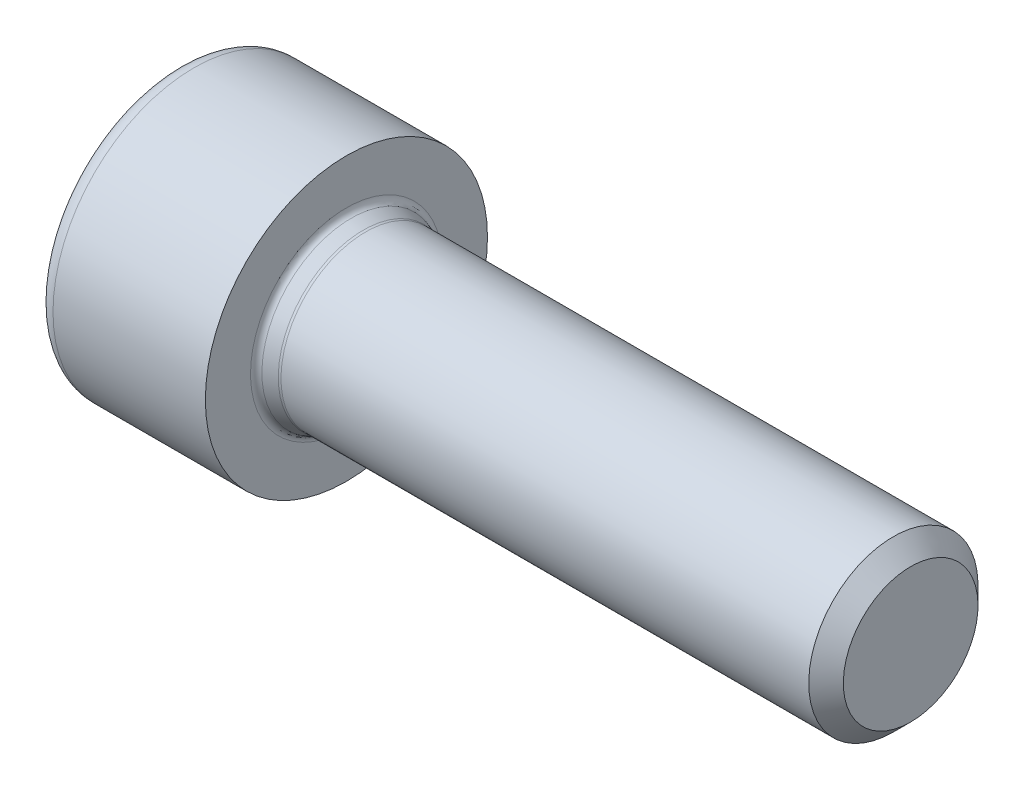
from build123d import *

# Parameters (mm, degrees)
ENL_V_MAT_EXTRU_1_DEPTH = 6


with BuildPart() as part:
    # Esquisse1 → R_volution1 (revolve)
    with BuildSketch(Plane.XY, mode=Mode.PRIVATE) as r_volution1_sk:
        with BuildLine():
            Line((-0.85, 0), (-2.3, 2.5))
            Line((-2.3, 2.5), (-5.64, 2.5))
            Line((-5.64, 2.5), (-6, 2.86))
            Line((-6, 2.86), (-6, 4.4))
            ThreePointArc((-6, 4.4), (-5.824264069, 4.824264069), (-5.4, 5))
            Line((-5.4, 5), (0, 5))
            Line((0, 5), (0, 3.4))
            ThreePointArc((0, 3.4), (0.046179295, 3.255234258), (0.167656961, 3.163949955))
            Line((0.167656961, 3.163949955), (0.597656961, 3.013949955))
            ThreePointArc((0.597656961, 3.013949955), (0.638241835, 3.003512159), (0.68, 3))
            Line((0.68, 3), (19.3865, 3))
            Line((19.3865, 3), (20, 2.3865))
            Line((20, 2.3865), (20, 0))
            Line((20, 0), (-0.85, 0))
        make_face()
    revolve(r_volution1_sk.sketch.rotate(Axis((28.006624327, 0, 0), (-1, 0, 0)), 180), axis=Axis((28.006624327, 0, 0), (-1, 0, 0)))

    # Esquisse2 → Enl_v. mat.-Extru.1 (cut)
    with BuildSketch(Plane(origin=(-2.3, 0, 0), x_dir=(0, 0, -1), z_dir=(1, 0, 0))):
        Polygon((-2.5, 1.443375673), (-2.5, -1.443375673), (0, -2.886751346), (2.5, -1.443375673), (2.5, 1.443375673), (0, 2.886751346), align=None)
    extrude(amount=-ENL_V_MAT_EXTRU_1_DEPTH, mode=Mode.SUBTRACT)


solid = part.part
